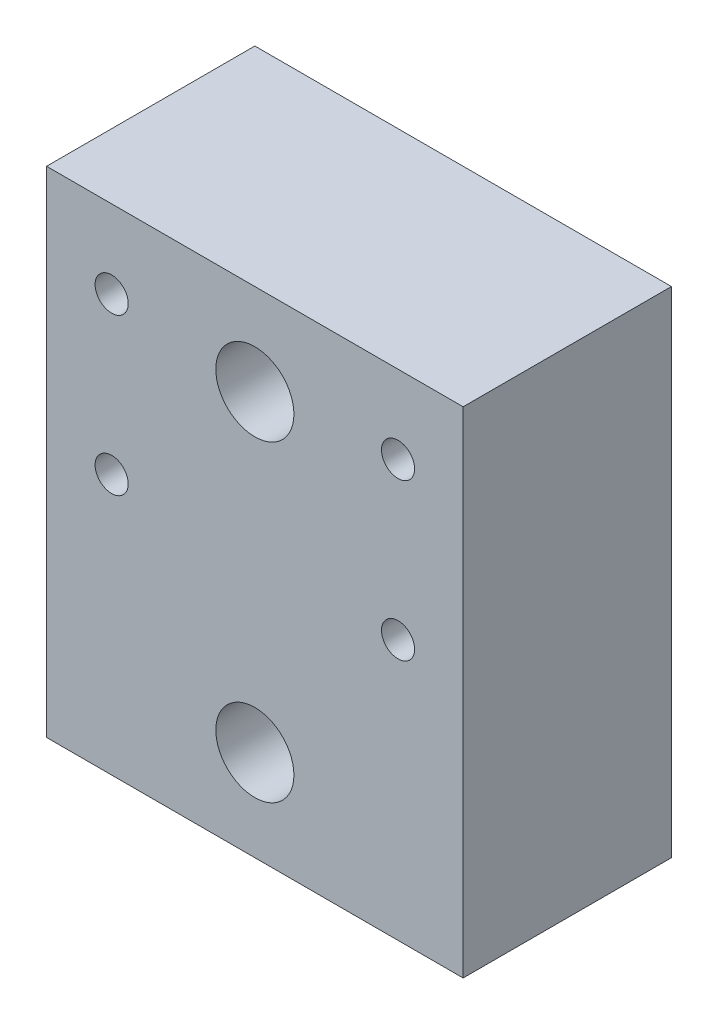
ISO-10303-21;
HEADER;
FILE_DESCRIPTION(('STEP AP214'),'2;1');
FILE_NAME('part.step','',(''),(''),'','','');
FILE_SCHEMA(('AUTOMOTIVE_DESIGN { 1 0 10303 214 1 1 1 1 }'));
ENDSEC;
DATA;
#1=APPLICATION_CONTEXT('core data for automotive mechanical design processes');
#2=APPLICATION_PROTOCOL_DEFINITION('international standard','automotive_design',2000,#1);
#3=PRODUCT_CONTEXT('',#1,'mechanical');
#4=PRODUCT('Part','Part','',(#3));
#5=PRODUCT_RELATED_PRODUCT_CATEGORY('part','',(#4));
#6=PRODUCT_DEFINITION_FORMATION('','',#4);
#7=PRODUCT_DEFINITION_CONTEXT('part definition',#1,'design');
#8=PRODUCT_DEFINITION('design','',#6,#7);
#9=PRODUCT_DEFINITION_SHAPE('','',#8);
#10=(LENGTH_UNIT() NAMED_UNIT(*) SI_UNIT(.MILLI.,.METRE.));
#11=(NAMED_UNIT(*) PLANE_ANGLE_UNIT() SI_UNIT($,.RADIAN.));
#12=(NAMED_UNIT(*) SI_UNIT($,.STERADIAN.) SOLID_ANGLE_UNIT());
#13=UNCERTAINTY_MEASURE_WITH_UNIT(LENGTH_MEASURE(1.E-05),#10,'distance_accuracy_value','');
#14=(GEOMETRIC_REPRESENTATION_CONTEXT(3) GLOBAL_UNCERTAINTY_ASSIGNED_CONTEXT((#13)) GLOBAL_UNIT_ASSIGNED_CONTEXT((#10,
#11,#12)) REPRESENTATION_CONTEXT('',''));
#15=CARTESIAN_POINT('',(0.,0.,0.));
#16=DIRECTION('',(0.,0.,1.));
#17=DIRECTION('',(1.,0.,0.));
#18=AXIS2_PLACEMENT_3D('',#15,#16,#17);
#19=CARTESIAN_POINT('',(25.4,30.1625,12.7));
#20=DIRECTION('',(-1.,0.,0.));
#21=DIRECTION('',(0.,-1.,0.));
#22=AXIS2_PLACEMENT_3D('',#19,#20,#21);
#23=PLANE('',#22);
#24=DIRECTION('',(0.,1.,0.));
#25=VECTOR('',#24,1.);
#26=CARTESIAN_POINT('',(25.4,30.1625,-12.7));
#27=LINE('',#26,#25);
#28=CARTESIAN_POINT('',(25.4,-30.1625,-12.7));
#29=VERTEX_POINT('',#28);
#30=CARTESIAN_POINT('',(25.4,30.1625,-12.7));
#31=VERTEX_POINT('',#30);
#32=EDGE_CURVE('E118',#29,#31,#27,.T.);
#33=ORIENTED_EDGE('',*,*,#32,.T.);
#34=DIRECTION('',(0.,0.,-1.));
#35=VECTOR('',#34,1.);
#36=CARTESIAN_POINT('',(25.4,30.1625,12.7));
#37=LINE('',#36,#35);
#38=CARTESIAN_POINT('',(25.4,30.1625,12.7));
#39=VERTEX_POINT('',#38);
#40=EDGE_CURVE('E11',#39,#31,#37,.T.);
#41=ORIENTED_EDGE('',*,*,#40,.F.);
#42=DIRECTION('',(0.,1.,0.));
#43=VECTOR('',#42,1.);
#44=CARTESIAN_POINT('',(25.4,30.1625,12.7));
#45=LINE('',#44,#43);
#46=CARTESIAN_POINT('',(25.4,-30.1625,12.7));
#47=VERTEX_POINT('',#46);
#48=EDGE_CURVE('E101',#47,#39,#45,.T.);
#49=ORIENTED_EDGE('',*,*,#48,.F.);
#50=DIRECTION('',(0.,0.,-1.));
#51=VECTOR('',#50,1.);
#52=CARTESIAN_POINT('',(25.4,-30.1625,12.7));
#53=LINE('',#52,#51);
#54=EDGE_CURVE('E114',#47,#29,#53,.T.);
#55=ORIENTED_EDGE('',*,*,#54,.T.);
#56=EDGE_LOOP('',(#33,#41,#49,#55));
#57=FACE_BOUND('',#56,.T.);
#58=ADVANCED_FACE('F43',(#57),#23,.F.);
#59=CARTESIAN_POINT('',(-25.4,30.1625,12.7));
#60=DIRECTION('',(0.,-1.,0.));
#61=DIRECTION('',(0.,0.,-1.));
#62=AXIS2_PLACEMENT_3D('',#59,#60,#61);
#63=PLANE('',#62);
#64=DIRECTION('',(-1.,0.,0.));
#65=VECTOR('',#64,1.);
#66=CARTESIAN_POINT('',(-25.4,30.1625,-12.7));
#67=LINE('',#66,#65);
#68=CARTESIAN_POINT('',(-25.4,30.1625,-12.7));
#69=VERTEX_POINT('',#68);
#70=EDGE_CURVE('E106',#31,#69,#67,.T.);
#71=ORIENTED_EDGE('',*,*,#70,.T.);
#72=DIRECTION('',(0.,0.,-1.));
#73=VECTOR('',#72,1.);
#74=CARTESIAN_POINT('',(-25.4,30.1625,12.7));
#75=LINE('',#74,#73);
#76=CARTESIAN_POINT('',(-25.4,30.1625,12.7));
#77=VERTEX_POINT('',#76);
#78=EDGE_CURVE('E52',#77,#69,#75,.T.);
#79=ORIENTED_EDGE('',*,*,#78,.F.);
#80=DIRECTION('',(-1.,0.,0.));
#81=VECTOR('',#80,1.);
#82=CARTESIAN_POINT('',(-25.4,30.1625,12.7));
#83=LINE('',#82,#81);
#84=EDGE_CURVE('E95',#39,#77,#83,.T.);
#85=ORIENTED_EDGE('',*,*,#84,.F.);
#86=ORIENTED_EDGE('',*,*,#40,.T.);
#87=EDGE_LOOP('',(#71,#79,#85,#86));
#88=FACE_BOUND('',#87,.T.);
#89=ADVANCED_FACE('F105',(#88),#63,.F.);
#90=CARTESIAN_POINT('',(-25.4,30.1625,12.7));
#91=DIRECTION('',(1.,0.,0.));
#92=DIRECTION('',(0.,1.,0.));
#93=AXIS2_PLACEMENT_3D('',#90,#91,#92);
#94=PLANE('',#93);
#95=DIRECTION('',(0.,-1.,0.));
#96=VECTOR('',#95,1.);
#97=CARTESIAN_POINT('',(-25.4,30.1625,-12.7));
#98=LINE('',#97,#96);
#99=CARTESIAN_POINT('',(-25.4,-30.1625,-12.7));
#100=VERTEX_POINT('',#99);
#101=EDGE_CURVE('E81',#69,#100,#98,.T.);
#102=ORIENTED_EDGE('',*,*,#101,.T.);
#103=DIRECTION('',(0.,0.,-1.));
#104=VECTOR('',#103,1.);
#105=CARTESIAN_POINT('',(-25.4,-30.1625,12.7));
#106=LINE('',#105,#104);
#107=CARTESIAN_POINT('',(-25.4,-30.1625,12.7));
#108=VERTEX_POINT('',#107);
#109=EDGE_CURVE('E108',#108,#100,#106,.T.);
#110=ORIENTED_EDGE('',*,*,#109,.F.);
#111=DIRECTION('',(0.,-1.,0.));
#112=VECTOR('',#111,1.);
#113=CARTESIAN_POINT('',(-25.4,30.1625,12.7));
#114=LINE('',#113,#112);
#115=EDGE_CURVE('E99',#77,#108,#114,.T.);
#116=ORIENTED_EDGE('',*,*,#115,.F.);
#117=ORIENTED_EDGE('',*,*,#78,.T.);
#118=EDGE_LOOP('',(#102,#110,#116,#117));
#119=FACE_BOUND('',#118,.T.);
#120=ADVANCED_FACE('F109',(#119),#94,.F.);
#121=CARTESIAN_POINT('',(-25.4,-30.1625,12.7));
#122=DIRECTION('',(0.,1.,0.));
#123=DIRECTION('',(0.,0.,1.));
#124=AXIS2_PLACEMENT_3D('',#121,#122,#123);
#125=PLANE('',#124);
#126=DIRECTION('',(1.,0.,0.));
#127=VECTOR('',#126,1.);
#128=CARTESIAN_POINT('',(-25.4,-30.1625,-12.7));
#129=LINE('',#128,#127);
#130=EDGE_CURVE('E87',#100,#29,#129,.T.);
#131=ORIENTED_EDGE('',*,*,#130,.T.);
#132=ORIENTED_EDGE('',*,*,#54,.F.);
#133=DIRECTION('',(1.,0.,0.));
#134=VECTOR('',#133,1.);
#135=CARTESIAN_POINT('',(-25.4,-30.1625,12.7));
#136=LINE('',#135,#134);
#137=EDGE_CURVE('E60',#108,#47,#136,.T.);
#138=ORIENTED_EDGE('',*,*,#137,.F.);
#139=ORIENTED_EDGE('',*,*,#109,.T.);
#140=EDGE_LOOP('',(#131,#132,#138,#139));
#141=FACE_BOUND('',#140,.T.);
#142=ADVANCED_FACE('F131',(#141),#125,.F.);
#143=CARTESIAN_POINT('',(0.,0.,12.7));
#144=DIRECTION('',(0.,0.,1.));
#145=DIRECTION('',(1.,0.,0.));
#146=AXIS2_PLACEMENT_3D('',#143,#144,#145);
#147=PLANE('',#146);
#148=CARTESIAN_POINT('',(-17.4625,20.6375,12.7));
#149=DIRECTION('',(0.,0.,1.));
#150=DIRECTION('',(1.,0.,0.));
#151=AXIS2_PLACEMENT_3D('',#148,#149,#150);
#152=CIRCLE('',#151,2.01929999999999);
#153=CARTESIAN_POINT('',(-15.4432,20.6375,12.7));
#154=VERTEX_POINT('',#153);
#155=EDGE_CURVE('E196',#154,#154,#152,.T.);
#156=ORIENTED_EDGE('',*,*,#155,.F.);
#157=EDGE_LOOP('',(#156));
#158=FACE_BOUND('',#157,.T.);
#159=CARTESIAN_POINT('',(17.4625,20.6375,12.7));
#160=DIRECTION('',(0.,0.,1.));
#161=DIRECTION('',(1.,0.,0.));
#162=AXIS2_PLACEMENT_3D('',#159,#160,#161);
#163=CIRCLE('',#162,2.01929999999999);
#164=CARTESIAN_POINT('',(19.4818,20.6375,12.7));
#165=VERTEX_POINT('',#164);
#166=EDGE_CURVE('E189',#165,#165,#163,.T.);
#167=ORIENTED_EDGE('',*,*,#166,.F.);
#168=EDGE_LOOP('',(#167));
#169=FACE_BOUND('',#168,.T.);
#170=CARTESIAN_POINT('',(17.4625,1.58750000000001,12.7));
#171=DIRECTION('',(0.,0.,1.));
#172=DIRECTION('',(1.,0.,0.));
#173=AXIS2_PLACEMENT_3D('',#170,#171,#172);
#174=CIRCLE('',#173,2.01929999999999);
#175=CARTESIAN_POINT('',(19.4818,1.58750000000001,12.7));
#176=VERTEX_POINT('',#175);
#177=EDGE_CURVE('E181',#176,#176,#174,.T.);
#178=ORIENTED_EDGE('',*,*,#177,.F.);
#179=EDGE_LOOP('',(#178));
#180=FACE_BOUND('',#179,.T.);
#181=CARTESIAN_POINT('',(-17.4625,1.58750000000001,12.7));
#182=DIRECTION('',(0.,0.,1.));
#183=DIRECTION('',(1.,0.,0.));
#184=AXIS2_PLACEMENT_3D('',#181,#182,#183);
#185=CIRCLE('',#184,2.01929999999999);
#186=CARTESIAN_POINT('',(-15.4432,1.58750000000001,12.7));
#187=VERTEX_POINT('',#186);
#188=EDGE_CURVE('E173',#187,#187,#185,.T.);
#189=ORIENTED_EDGE('',*,*,#188,.F.);
#190=EDGE_LOOP('',(#189));
#191=FACE_BOUND('',#190,.T.);
#192=CARTESIAN_POINT('',(0.,19.05,12.7));
#193=DIRECTION('',(0.,0.,1.));
#194=DIRECTION('',(1.,0.,0.));
#195=AXIS2_PLACEMENT_3D('',#192,#193,#194);
#196=CIRCLE('',#195,4.7625);
#197=CARTESIAN_POINT('',(4.7625,19.05,12.7));
#198=VERTEX_POINT('',#197);
#199=EDGE_CURVE('E166',#198,#198,#196,.T.);
#200=ORIENTED_EDGE('',*,*,#199,.F.);
#201=EDGE_LOOP('',(#200));
#202=FACE_BOUND('',#201,.T.);
#203=CARTESIAN_POINT('',(0.,-19.05,12.7));
#204=DIRECTION('',(0.,0.,1.));
#205=DIRECTION('',(1.,0.,0.));
#206=AXIS2_PLACEMENT_3D('',#203,#204,#205);
#207=CIRCLE('',#206,4.7625);
#208=CARTESIAN_POINT('',(4.7625,-19.05,12.7));
#209=VERTEX_POINT('',#208);
#210=EDGE_CURVE('E150',#209,#209,#207,.T.);
#211=ORIENTED_EDGE('',*,*,#210,.F.);
#212=EDGE_LOOP('',(#211));
#213=FACE_BOUND('',#212,.T.);
#214=ORIENTED_EDGE('',*,*,#48,.T.);
#215=ORIENTED_EDGE('',*,*,#84,.T.);
#216=ORIENTED_EDGE('',*,*,#115,.T.);
#217=ORIENTED_EDGE('',*,*,#137,.T.);
#218=EDGE_LOOP('',(#214,#215,#216,#217));
#219=FACE_BOUND('',#218,.T.);
#220=ADVANCED_FACE('F97',(#158,#169,#180,#191,#202,#213,#219),#147,.T.);
#221=CARTESIAN_POINT('',(0.,0.,-12.7));
#222=DIRECTION('',(0.,0.,1.));
#223=DIRECTION('',(1.,0.,0.));
#224=AXIS2_PLACEMENT_3D('',#221,#222,#223);
#225=PLANE('',#224);
#226=CARTESIAN_POINT('',(-17.4625,20.6375,-12.7));
#227=DIRECTION('',(0.,0.,1.));
#228=DIRECTION('',(1.,0.,0.));
#229=AXIS2_PLACEMENT_3D('',#226,#227,#228);
#230=CIRCLE('',#229,2.01929999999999);
#231=CARTESIAN_POINT('',(-15.4432,20.6375,-12.7));
#232=VERTEX_POINT('',#231);
#233=EDGE_CURVE('E192',#232,#232,#230,.T.);
#234=ORIENTED_EDGE('',*,*,#233,.T.);
#235=EDGE_LOOP('',(#234));
#236=FACE_BOUND('',#235,.T.);
#237=CARTESIAN_POINT('',(17.4625,20.6375,-12.7));
#238=DIRECTION('',(0.,0.,1.));
#239=DIRECTION('',(1.,0.,0.));
#240=AXIS2_PLACEMENT_3D('',#237,#238,#239);
#241=CIRCLE('',#240,2.01929999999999);
#242=CARTESIAN_POINT('',(19.4818,20.6375,-12.7));
#243=VERTEX_POINT('',#242);
#244=EDGE_CURVE('E185',#243,#243,#241,.T.);
#245=ORIENTED_EDGE('',*,*,#244,.T.);
#246=EDGE_LOOP('',(#245));
#247=FACE_BOUND('',#246,.T.);
#248=CARTESIAN_POINT('',(17.4625,1.58750000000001,-12.7));
#249=DIRECTION('',(0.,0.,1.));
#250=DIRECTION('',(1.,0.,0.));
#251=AXIS2_PLACEMENT_3D('',#248,#249,#250);
#252=CIRCLE('',#251,2.01929999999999);
#253=CARTESIAN_POINT('',(19.4818,1.58750000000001,-12.7));
#254=VERTEX_POINT('',#253);
#255=EDGE_CURVE('E177',#254,#254,#252,.T.);
#256=ORIENTED_EDGE('',*,*,#255,.T.);
#257=EDGE_LOOP('',(#256));
#258=FACE_BOUND('',#257,.T.);
#259=CARTESIAN_POINT('',(-17.4625,1.58750000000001,-12.7));
#260=DIRECTION('',(0.,0.,1.));
#261=DIRECTION('',(1.,0.,0.));
#262=AXIS2_PLACEMENT_3D('',#259,#260,#261);
#263=CIRCLE('',#262,2.01929999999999);
#264=CARTESIAN_POINT('',(-15.4432,1.58750000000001,-12.7));
#265=VERTEX_POINT('',#264);
#266=EDGE_CURVE('E170',#265,#265,#263,.T.);
#267=ORIENTED_EDGE('',*,*,#266,.T.);
#268=EDGE_LOOP('',(#267));
#269=FACE_BOUND('',#268,.T.);
#270=CARTESIAN_POINT('',(0.,19.05,-12.7));
#271=DIRECTION('',(0.,0.,1.));
#272=DIRECTION('',(1.,0.,0.));
#273=AXIS2_PLACEMENT_3D('',#270,#271,#272);
#274=CIRCLE('',#273,2.8067);
#275=CARTESIAN_POINT('',(2.8067,19.05,-12.7));
#276=VERTEX_POINT('',#275);
#277=EDGE_CURVE('E154',#276,#276,#274,.T.);
#278=ORIENTED_EDGE('',*,*,#277,.T.);
#279=EDGE_LOOP('',(#278));
#280=FACE_BOUND('',#279,.T.);
#281=CARTESIAN_POINT('',(0.,-19.05,-12.7));
#282=DIRECTION('',(0.,0.,1.));
#283=DIRECTION('',(1.,0.,0.));
#284=AXIS2_PLACEMENT_3D('',#281,#282,#283);
#285=CIRCLE('',#284,2.8067);
#286=CARTESIAN_POINT('',(2.8067,-19.05,-12.7));
#287=VERTEX_POINT('',#286);
#288=EDGE_CURVE('E122',#287,#287,#285,.T.);
#289=ORIENTED_EDGE('',*,*,#288,.T.);
#290=EDGE_LOOP('',(#289));
#291=FACE_BOUND('',#290,.T.);
#292=ORIENTED_EDGE('',*,*,#32,.F.);
#293=ORIENTED_EDGE('',*,*,#130,.F.);
#294=ORIENTED_EDGE('',*,*,#101,.F.);
#295=ORIENTED_EDGE('',*,*,#70,.F.);
#296=EDGE_LOOP('',(#292,#293,#294,#295));
#297=FACE_BOUND('',#296,.T.);
#298=ADVANCED_FACE('F134',(#236,#247,#258,#269,#280,#291,#297),#225,.F.);
#299=CARTESIAN_POINT('',(0.,-19.05,12.7));
#300=DIRECTION('',(0.,0.,1.));
#301=DIRECTION('',(1.,0.,0.));
#302=AXIS2_PLACEMENT_3D('',#299,#300,#301);
#303=CYLINDRICAL_SURFACE('',#302,2.8067);
#304=ORIENTED_EDGE('',*,*,#288,.F.);
#305=EDGE_LOOP('',(#304));
#306=FACE_BOUND('',#305,.T.);
#307=CARTESIAN_POINT('',(0.,-19.05,-2.413));
#308=DIRECTION('',(0.,0.,1.));
#309=DIRECTION('',(1.,0.,0.));
#310=AXIS2_PLACEMENT_3D('',#307,#308,#309);
#311=CIRCLE('',#310,2.8067);
#312=CARTESIAN_POINT('',(2.8067,-19.05,-2.413));
#313=VERTEX_POINT('',#312);
#314=EDGE_CURVE('E142',#313,#313,#311,.T.);
#315=ORIENTED_EDGE('',*,*,#314,.T.);
#316=EDGE_LOOP('',(#315));
#317=FACE_BOUND('',#316,.T.);
#318=ADVANCED_FACE('F229',(#306,#317),#303,.F.);
#319=CARTESIAN_POINT('',(2.8067,-19.05,-2.413));
#320=DIRECTION('',(0.,0.,-1.));
#321=DIRECTION('',(-1.,0.,0.));
#322=AXIS2_PLACEMENT_3D('',#319,#320,#321);
#323=PLANE('',#322);
#324=ORIENTED_EDGE('',*,*,#314,.F.);
#325=EDGE_LOOP('',(#324));
#326=FACE_BOUND('',#325,.T.);
#327=CARTESIAN_POINT('',(0.,-19.05,-2.413));
#328=DIRECTION('',(0.,0.,1.));
#329=DIRECTION('',(1.,0.,0.));
#330=AXIS2_PLACEMENT_3D('',#327,#328,#329);
#331=CIRCLE('',#330,4.7625);
#332=CARTESIAN_POINT('',(4.7625,-19.05,-2.413));
#333=VERTEX_POINT('',#332);
#334=EDGE_CURVE('E146',#333,#333,#331,.T.);
#335=ORIENTED_EDGE('',*,*,#334,.T.);
#336=EDGE_LOOP('',(#335));
#337=FACE_BOUND('',#336,.T.);
#338=ADVANCED_FACE('F219',(#326,#337),#323,.F.);
#339=CARTESIAN_POINT('',(0.,-19.05,12.7));
#340=DIRECTION('',(0.,0.,1.));
#341=DIRECTION('',(1.,0.,0.));
#342=AXIS2_PLACEMENT_3D('',#339,#340,#341);
#343=CYLINDRICAL_SURFACE('',#342,4.7625);
#344=ORIENTED_EDGE('',*,*,#334,.F.);
#345=EDGE_LOOP('',(#344));
#346=FACE_BOUND('',#345,.T.);
#347=ORIENTED_EDGE('',*,*,#210,.T.);
#348=EDGE_LOOP('',(#347));
#349=FACE_BOUND('',#348,.T.);
#350=ADVANCED_FACE('F216',(#346,#349),#343,.F.);
#351=CARTESIAN_POINT('',(0.,19.05,12.7));
#352=DIRECTION('',(0.,0.,1.));
#353=DIRECTION('',(1.,0.,0.));
#354=AXIS2_PLACEMENT_3D('',#351,#352,#353);
#355=CYLINDRICAL_SURFACE('',#354,2.8067);
#356=ORIENTED_EDGE('',*,*,#277,.F.);
#357=EDGE_LOOP('',(#356));
#358=FACE_BOUND('',#357,.T.);
#359=CARTESIAN_POINT('',(0.,19.05,-2.413));
#360=DIRECTION('',(0.,0.,1.));
#361=DIRECTION('',(1.,0.,0.));
#362=AXIS2_PLACEMENT_3D('',#359,#360,#361);
#363=CIRCLE('',#362,2.8067);
#364=CARTESIAN_POINT('',(2.8067,19.05,-2.413));
#365=VERTEX_POINT('',#364);
#366=EDGE_CURVE('E158',#365,#365,#363,.T.);
#367=ORIENTED_EDGE('',*,*,#366,.T.);
#368=EDGE_LOOP('',(#367));
#369=FACE_BOUND('',#368,.T.);
#370=ADVANCED_FACE('F218',(#358,#369),#355,.F.);
#371=CARTESIAN_POINT('',(2.8067,19.05,-2.413));
#372=DIRECTION('',(0.,0.,-1.));
#373=DIRECTION('',(-1.,0.,0.));
#374=AXIS2_PLACEMENT_3D('',#371,#372,#373);
#375=PLANE('',#374);
#376=ORIENTED_EDGE('',*,*,#366,.F.);
#377=EDGE_LOOP('',(#376));
#378=FACE_BOUND('',#377,.T.);
#379=CARTESIAN_POINT('',(0.,19.05,-2.413));
#380=DIRECTION('',(0.,0.,1.));
#381=DIRECTION('',(1.,0.,0.));
#382=AXIS2_PLACEMENT_3D('',#379,#380,#381);
#383=CIRCLE('',#382,4.7625);
#384=CARTESIAN_POINT('',(4.7625,19.05,-2.413));
#385=VERTEX_POINT('',#384);
#386=EDGE_CURVE('E162',#385,#385,#383,.T.);
#387=ORIENTED_EDGE('',*,*,#386,.T.);
#388=EDGE_LOOP('',(#387));
#389=FACE_BOUND('',#388,.T.);
#390=ADVANCED_FACE('F226',(#378,#389),#375,.F.);
#391=CARTESIAN_POINT('',(0.,19.05,12.7));
#392=DIRECTION('',(0.,0.,1.));
#393=DIRECTION('',(1.,0.,0.));
#394=AXIS2_PLACEMENT_3D('',#391,#392,#393);
#395=CYLINDRICAL_SURFACE('',#394,4.7625);
#396=ORIENTED_EDGE('',*,*,#386,.F.);
#397=EDGE_LOOP('',(#396));
#398=FACE_BOUND('',#397,.T.);
#399=ORIENTED_EDGE('',*,*,#199,.T.);
#400=EDGE_LOOP('',(#399));
#401=FACE_BOUND('',#400,.T.);
#402=ADVANCED_FACE('F283',(#398,#401),#395,.F.);
#403=CARTESIAN_POINT('',(-17.4625,1.58750000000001,12.7));
#404=DIRECTION('',(0.,0.,1.));
#405=DIRECTION('',(1.,0.,0.));
#406=AXIS2_PLACEMENT_3D('',#403,#404,#405);
#407=CYLINDRICAL_SURFACE('',#406,2.01929999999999);
#408=ORIENTED_EDGE('',*,*,#266,.F.);
#409=EDGE_LOOP('',(#408));
#410=FACE_BOUND('',#409,.T.);
#411=ORIENTED_EDGE('',*,*,#188,.T.);
#412=EDGE_LOOP('',(#411));
#413=FACE_BOUND('',#412,.T.);
#414=ADVANCED_FACE('F293',(#410,#413),#407,.F.);
#415=CARTESIAN_POINT('',(17.4625,1.58750000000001,12.7));
#416=DIRECTION('',(0.,0.,1.));
#417=DIRECTION('',(1.,0.,0.));
#418=AXIS2_PLACEMENT_3D('',#415,#416,#417);
#419=CYLINDRICAL_SURFACE('',#418,2.01929999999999);
#420=ORIENTED_EDGE('',*,*,#255,.F.);
#421=EDGE_LOOP('',(#420));
#422=FACE_BOUND('',#421,.T.);
#423=ORIENTED_EDGE('',*,*,#177,.T.);
#424=EDGE_LOOP('',(#423));
#425=FACE_BOUND('',#424,.T.);
#426=ADVANCED_FACE('F316',(#422,#425),#419,.F.);
#427=CARTESIAN_POINT('',(17.4625,20.6375,12.7));
#428=DIRECTION('',(0.,0.,1.));
#429=DIRECTION('',(1.,0.,0.));
#430=AXIS2_PLACEMENT_3D('',#427,#428,#429);
#431=CYLINDRICAL_SURFACE('',#430,2.01929999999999);
#432=ORIENTED_EDGE('',*,*,#244,.F.);
#433=EDGE_LOOP('',(#432));
#434=FACE_BOUND('',#433,.T.);
#435=ORIENTED_EDGE('',*,*,#166,.T.);
#436=EDGE_LOOP('',(#435));
#437=FACE_BOUND('',#436,.T.);
#438=ADVANCED_FACE('F329',(#434,#437),#431,.F.);
#439=CARTESIAN_POINT('',(-17.4625,20.6375,12.7));
#440=DIRECTION('',(0.,0.,1.));
#441=DIRECTION('',(1.,0.,0.));
#442=AXIS2_PLACEMENT_3D('',#439,#440,#441);
#443=CYLINDRICAL_SURFACE('',#442,2.01929999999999);
#444=ORIENTED_EDGE('',*,*,#233,.F.);
#445=EDGE_LOOP('',(#444));
#446=FACE_BOUND('',#445,.T.);
#447=ORIENTED_EDGE('',*,*,#155,.T.);
#448=EDGE_LOOP('',(#447));
#449=FACE_BOUND('',#448,.T.);
#450=ADVANCED_FACE('F201',(#446,#449),#443,.F.);
#451=CLOSED_SHELL('',(#58,#89,#120,#142,#220,#298,#318,#338,#350,#370,#390,#402,#414,#426,#438,#450));
#452=MANIFOLD_SOLID_BREP('B2',#451);
#453=ADVANCED_BREP_SHAPE_REPRESENTATION('',(#18,#452),#14);
#454=SHAPE_DEFINITION_REPRESENTATION(#9,#453);
ENDSEC;
END-ISO-10303-21;
